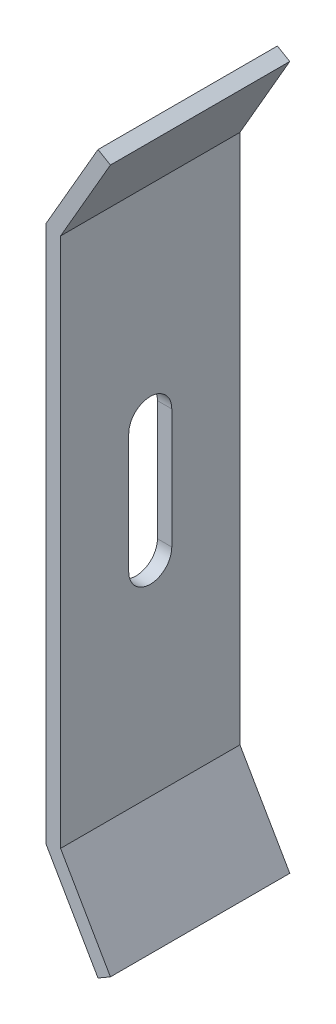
ISO-10303-21;
HEADER;
FILE_DESCRIPTION(('STEP AP214'),'2;1');
FILE_NAME('part.step','',(''),(''),'','','');
FILE_SCHEMA(('AUTOMOTIVE_DESIGN { 1 0 10303 214 1 1 1 1 }'));
ENDSEC;
DATA;
#1=APPLICATION_CONTEXT('core data for automotive mechanical design processes');
#2=APPLICATION_PROTOCOL_DEFINITION('international standard','automotive_design',2000,#1);
#3=PRODUCT_CONTEXT('',#1,'mechanical');
#4=PRODUCT('Part','Part','',(#3));
#5=PRODUCT_RELATED_PRODUCT_CATEGORY('part','',(#4));
#6=PRODUCT_DEFINITION_FORMATION('','',#4);
#7=PRODUCT_DEFINITION_CONTEXT('part definition',#1,'design');
#8=PRODUCT_DEFINITION('design','',#6,#7);
#9=PRODUCT_DEFINITION_SHAPE('','',#8);
#10=(LENGTH_UNIT() NAMED_UNIT(*) SI_UNIT(.MILLI.,.METRE.));
#11=(NAMED_UNIT(*) PLANE_ANGLE_UNIT() SI_UNIT($,.RADIAN.));
#12=(NAMED_UNIT(*) SI_UNIT($,.STERADIAN.) SOLID_ANGLE_UNIT());
#13=UNCERTAINTY_MEASURE_WITH_UNIT(LENGTH_MEASURE(1.E-05),#10,'distance_accuracy_value','');
#14=(GEOMETRIC_REPRESENTATION_CONTEXT(3) GLOBAL_UNCERTAINTY_ASSIGNED_CONTEXT((#13)) GLOBAL_UNIT_ASSIGNED_CONTEXT((#10,
#11,#12)) REPRESENTATION_CONTEXT('',''));
#15=CARTESIAN_POINT('',(0.,0.,0.));
#16=DIRECTION('',(0.,0.,1.));
#17=DIRECTION('',(1.,0.,0.));
#18=AXIS2_PLACEMENT_3D('',#15,#16,#17);
#19=CARTESIAN_POINT('',(1.31982271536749,27.813,19.05));
#20=DIRECTION('',(-0.866025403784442,0.499999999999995,0.));
#21=DIRECTION('',(-0.499999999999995,-0.866025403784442,0.));
#22=AXIS2_PLACEMENT_3D('',#19,#20,#21);
#23=PLANE('',#22);
#24=DIRECTION('',(0.499999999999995,0.866025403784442,0.));
#25=VECTOR('',#24,1.);
#26=CARTESIAN_POINT('',(1.31982271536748,27.813,0.));
#27=LINE('',#26,#25);
#28=CARTESIAN_POINT('',(1.524,28.1666454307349,0.));
#29=VERTEX_POINT('',#28);
#30=CARTESIAN_POINT('',(6.8190840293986,37.3380000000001,0.));
#31=VERTEX_POINT('',#30);
#32=EDGE_CURVE('E153',#29,#31,#27,.T.);
#33=ORIENTED_EDGE('',*,*,#32,.T.);
#34=DIRECTION('',(0.,0.,-1.));
#35=VECTOR('',#34,1.);
#36=CARTESIAN_POINT('',(6.8190840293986,37.3380000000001,19.05));
#37=LINE('',#36,#35);
#38=CARTESIAN_POINT('',(6.8190840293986,37.3380000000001,19.05));
#39=VERTEX_POINT('',#38);
#40=EDGE_CURVE('E11',#39,#31,#37,.T.);
#41=ORIENTED_EDGE('',*,*,#40,.F.);
#42=DIRECTION('',(0.499999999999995,0.866025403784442,0.));
#43=VECTOR('',#42,1.);
#44=CARTESIAN_POINT('',(1.31982271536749,27.813,19.05));
#45=LINE('',#44,#43);
#46=CARTESIAN_POINT('',(1.524,28.1666454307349,19.05));
#47=VERTEX_POINT('',#46);
#48=EDGE_CURVE('E177',#47,#39,#45,.T.);
#49=ORIENTED_EDGE('',*,*,#48,.F.);
#50=DIRECTION('',(0.,0.,-1.));
#51=VECTOR('',#50,1.);
#52=CARTESIAN_POINT('',(1.524,28.1666454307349,19.05));
#53=LINE('',#52,#51);
#54=EDGE_CURVE('E198',#47,#29,#53,.T.);
#55=ORIENTED_EDGE('',*,*,#54,.T.);
#56=EDGE_LOOP('',(#33,#41,#49,#55));
#57=FACE_BOUND('',#56,.T.);
#58=ADVANCED_FACE('F32',(#57),#23,.F.);
#59=CARTESIAN_POINT('',(5.49926131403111,38.1000000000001,19.05));
#60=DIRECTION('',(0.499999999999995,0.866025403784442,0.));
#61=DIRECTION('',(-0.866025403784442,0.499999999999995,0.));
#62=AXIS2_PLACEMENT_3D('',#59,#60,#61);
#63=PLANE('',#62);
#64=DIRECTION('',(0.866025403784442,-0.499999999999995,0.));
#65=VECTOR('',#64,1.);
#66=CARTESIAN_POINT('',(5.49926131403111,38.1000000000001,0.));
#67=LINE('',#66,#65);
#68=CARTESIAN_POINT('',(5.49926131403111,38.1000000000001,0.));
#69=VERTEX_POINT('',#68);
#70=EDGE_CURVE('E158',#69,#31,#67,.T.);
#71=ORIENTED_EDGE('',*,*,#70,.F.);
#72=DIRECTION('',(0.,0.,-1.));
#73=VECTOR('',#72,1.);
#74=CARTESIAN_POINT('',(5.49926131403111,38.1000000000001,19.05));
#75=LINE('',#74,#73);
#76=CARTESIAN_POINT('',(5.49926131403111,38.1000000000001,19.05));
#77=VERTEX_POINT('',#76);
#78=EDGE_CURVE('E39',#77,#69,#75,.T.);
#79=ORIENTED_EDGE('',*,*,#78,.F.);
#80=DIRECTION('',(0.866025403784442,-0.499999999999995,0.));
#81=VECTOR('',#80,1.);
#82=CARTESIAN_POINT('',(5.49926131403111,38.1000000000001,19.05));
#83=LINE('',#82,#81);
#84=EDGE_CURVE('E179',#77,#39,#83,.T.);
#85=ORIENTED_EDGE('',*,*,#84,.T.);
#86=ORIENTED_EDGE('',*,*,#40,.T.);
#87=EDGE_LOOP('',(#71,#79,#85,#86));
#88=FACE_BOUND('',#87,.T.);
#89=ADVANCED_FACE('F218',(#88),#63,.T.);
#90=CARTESIAN_POINT('',(0.,28.5749999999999,19.05));
#91=DIRECTION('',(-0.866025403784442,0.499999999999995,0.));
#92=DIRECTION('',(-0.499999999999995,-0.866025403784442,0.));
#93=AXIS2_PLACEMENT_3D('',#90,#91,#92);
#94=PLANE('',#93);
#95=DIRECTION('',(0.499999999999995,0.866025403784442,0.));
#96=VECTOR('',#95,1.);
#97=CARTESIAN_POINT('',(0.,28.575,0.));
#98=LINE('',#97,#96);
#99=CARTESIAN_POINT('',(0.,28.575,0.));
#100=VERTEX_POINT('',#99);
#101=EDGE_CURVE('E161',#100,#69,#98,.T.);
#102=ORIENTED_EDGE('',*,*,#101,.F.);
#103=DIRECTION('',(0.,0.,-1.));
#104=VECTOR('',#103,1.);
#105=CARTESIAN_POINT('',(0.,28.5749999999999,19.05));
#106=LINE('',#105,#104);
#107=CARTESIAN_POINT('',(0.,28.5749999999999,19.05));
#108=VERTEX_POINT('',#107);
#109=EDGE_CURVE('E210',#108,#100,#106,.T.);
#110=ORIENTED_EDGE('',*,*,#109,.F.);
#111=DIRECTION('',(0.499999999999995,0.866025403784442,0.));
#112=VECTOR('',#111,1.);
#113=CARTESIAN_POINT('',(0.,28.5749999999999,19.05));
#114=LINE('',#113,#112);
#115=EDGE_CURVE('E182',#108,#77,#114,.T.);
#116=ORIENTED_EDGE('',*,*,#115,.T.);
#117=ORIENTED_EDGE('',*,*,#78,.T.);
#118=EDGE_LOOP('',(#102,#110,#116,#117));
#119=FACE_BOUND('',#118,.T.);
#120=ADVANCED_FACE('F214',(#119),#94,.T.);
#121=CARTESIAN_POINT('',(0.,28.5749999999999,19.05));
#122=DIRECTION('',(-1.,0.,0.));
#123=DIRECTION('',(0.,0.,1.));
#124=AXIS2_PLACEMENT_3D('',#121,#122,#123);
#125=PLANE('',#124);
#126=CARTESIAN_POINT('',(0.,6.35,9.52500000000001));
#127=DIRECTION('',(1.,0.,0.));
#128=DIRECTION('',(0.,0.,1.));
#129=AXIS2_PLACEMENT_3D('',#126,#127,#128);
#130=CIRCLE('',#129,2.286);
#131=CARTESIAN_POINT('',(0.,6.34999999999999,7.239));
#132=VERTEX_POINT('',#131);
#133=CARTESIAN_POINT('',(0.,6.34999999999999,11.811));
#134=VERTEX_POINT('',#133);
#135=EDGE_CURVE('E139',#132,#134,#130,.T.);
#136=ORIENTED_EDGE('',*,*,#135,.T.);
#137=DIRECTION('',(0.,-1.,0.));
#138=VECTOR('',#137,1.);
#139=CARTESIAN_POINT('',(0.,6.34999999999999,11.811));
#140=LINE('',#139,#138);
#141=CARTESIAN_POINT('',(0.,-6.35,11.811));
#142=VERTEX_POINT('',#141);
#143=EDGE_CURVE('E145',#134,#142,#140,.T.);
#144=ORIENTED_EDGE('',*,*,#143,.T.);
#145=CARTESIAN_POINT('',(0.,-6.35000000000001,9.52500000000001));
#146=DIRECTION('',(1.,0.,0.));
#147=DIRECTION('',(0.,0.,-1.));
#148=AXIS2_PLACEMENT_3D('',#145,#146,#147);
#149=CIRCLE('',#148,2.286);
#150=CARTESIAN_POINT('',(0.,-6.35,7.239));
#151=VERTEX_POINT('',#150);
#152=EDGE_CURVE('E46',#142,#151,#149,.T.);
#153=ORIENTED_EDGE('',*,*,#152,.T.);
#154=DIRECTION('',(0.,1.,0.));
#155=VECTOR('',#154,1.);
#156=CARTESIAN_POINT('',(0.,6.34999999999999,7.239));
#157=LINE('',#156,#155);
#158=EDGE_CURVE('E148',#151,#132,#157,.T.);
#159=ORIENTED_EDGE('',*,*,#158,.T.);
#160=EDGE_LOOP('',(#136,#144,#153,#159));
#161=FACE_BOUND('',#160,.T.);
#162=DIRECTION('',(0.,1.,0.));
#163=VECTOR('',#162,1.);
#164=CARTESIAN_POINT('',(0.,28.575,0.));
#165=LINE('',#164,#163);
#166=CARTESIAN_POINT('',(0.,-28.575,0.));
#167=VERTEX_POINT('',#166);
#168=EDGE_CURVE('E164',#167,#100,#165,.T.);
#169=ORIENTED_EDGE('',*,*,#168,.F.);
#170=DIRECTION('',(0.,0.,-1.));
#171=VECTOR('',#170,1.);
#172=CARTESIAN_POINT('',(0.,-28.575,19.05));
#173=LINE('',#172,#171);
#174=CARTESIAN_POINT('',(0.,-28.575,19.05));
#175=VERTEX_POINT('',#174);
#176=EDGE_CURVE('E208',#175,#167,#173,.T.);
#177=ORIENTED_EDGE('',*,*,#176,.F.);
#178=DIRECTION('',(0.,1.,0.));
#179=VECTOR('',#178,1.);
#180=CARTESIAN_POINT('',(0.,28.5749999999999,19.05));
#181=LINE('',#180,#179);
#182=EDGE_CURVE('E185',#175,#108,#181,.T.);
#183=ORIENTED_EDGE('',*,*,#182,.T.);
#184=ORIENTED_EDGE('',*,*,#109,.T.);
#185=EDGE_LOOP('',(#169,#177,#183,#184));
#186=FACE_BOUND('',#185,.T.);
#187=ADVANCED_FACE('F226',(#161,#186),#125,.T.);
#188=CARTESIAN_POINT('',(0.,-28.575,19.05));
#189=DIRECTION('',(-0.866025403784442,-0.499999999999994,0.));
#190=DIRECTION('',(0.499999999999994,-0.866025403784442,0.));
#191=AXIS2_PLACEMENT_3D('',#188,#189,#190);
#192=PLANE('',#191);
#193=DIRECTION('',(-0.499999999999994,0.866025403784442,0.));
#194=VECTOR('',#193,1.);
#195=CARTESIAN_POINT('',(0.,-28.575,0.));
#196=LINE('',#195,#194);
#197=CARTESIAN_POINT('',(5.49926131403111,-38.1,0.));
#198=VERTEX_POINT('',#197);
#199=EDGE_CURVE('E167',#198,#167,#196,.T.);
#200=ORIENTED_EDGE('',*,*,#199,.F.);
#201=DIRECTION('',(0.,0.,-1.));
#202=VECTOR('',#201,1.);
#203=CARTESIAN_POINT('',(5.49926131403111,-38.1,19.05));
#204=LINE('',#203,#202);
#205=CARTESIAN_POINT('',(5.49926131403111,-38.1,19.05));
#206=VERTEX_POINT('',#205);
#207=EDGE_CURVE('E206',#206,#198,#204,.T.);
#208=ORIENTED_EDGE('',*,*,#207,.F.);
#209=DIRECTION('',(-0.499999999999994,0.866025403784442,0.));
#210=VECTOR('',#209,1.);
#211=CARTESIAN_POINT('',(0.,-28.575,19.05));
#212=LINE('',#211,#210);
#213=EDGE_CURVE('E188',#206,#175,#212,.T.);
#214=ORIENTED_EDGE('',*,*,#213,.T.);
#215=ORIENTED_EDGE('',*,*,#176,.T.);
#216=EDGE_LOOP('',(#200,#208,#214,#215));
#217=FACE_BOUND('',#216,.T.);
#218=ADVANCED_FACE('F246',(#217),#192,.T.);
#219=CARTESIAN_POINT('',(6.81908402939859,-37.338,19.05));
#220=DIRECTION('',(0.499999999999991,-0.866025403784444,0.));
#221=DIRECTION('',(0.866025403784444,0.499999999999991,0.));
#222=AXIS2_PLACEMENT_3D('',#219,#220,#221);
#223=PLANE('',#222);
#224=DIRECTION('',(-0.866025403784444,-0.499999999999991,0.));
#225=VECTOR('',#224,1.);
#226=CARTESIAN_POINT('',(6.81908402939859,-37.338,0.));
#227=LINE('',#226,#225);
#228=CARTESIAN_POINT('',(6.81908402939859,-37.338,0.));
#229=VERTEX_POINT('',#228);
#230=EDGE_CURVE('E170',#229,#198,#227,.T.);
#231=ORIENTED_EDGE('',*,*,#230,.F.);
#232=DIRECTION('',(0.,0.,-1.));
#233=VECTOR('',#232,1.);
#234=CARTESIAN_POINT('',(6.81908402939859,-37.338,19.05));
#235=LINE('',#234,#233);
#236=CARTESIAN_POINT('',(6.81908402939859,-37.338,19.05));
#237=VERTEX_POINT('',#236);
#238=EDGE_CURVE('E204',#237,#229,#235,.T.);
#239=ORIENTED_EDGE('',*,*,#238,.F.);
#240=DIRECTION('',(-0.866025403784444,-0.499999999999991,0.));
#241=VECTOR('',#240,1.);
#242=CARTESIAN_POINT('',(6.81908402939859,-37.338,19.05));
#243=LINE('',#242,#241);
#244=EDGE_CURVE('E191',#237,#206,#243,.T.);
#245=ORIENTED_EDGE('',*,*,#244,.T.);
#246=ORIENTED_EDGE('',*,*,#207,.T.);
#247=EDGE_LOOP('',(#231,#239,#245,#246));
#248=FACE_BOUND('',#247,.T.);
#249=ADVANCED_FACE('F244',(#248),#223,.T.);
#250=CARTESIAN_POINT('',(1.31982271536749,-27.813,19.05));
#251=DIRECTION('',(-0.866025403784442,-0.499999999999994,0.));
#252=DIRECTION('',(0.499999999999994,-0.866025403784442,0.));
#253=AXIS2_PLACEMENT_3D('',#250,#251,#252);
#254=PLANE('',#253);
#255=DIRECTION('',(-0.499999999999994,0.866025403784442,0.));
#256=VECTOR('',#255,1.);
#257=CARTESIAN_POINT('',(1.3198227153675,-27.813,0.));
#258=LINE('',#257,#256);
#259=CARTESIAN_POINT('',(1.524,-28.1666454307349,0.));
#260=VERTEX_POINT('',#259);
#261=EDGE_CURVE('E173',#229,#260,#258,.T.);
#262=ORIENTED_EDGE('',*,*,#261,.T.);
#263=DIRECTION('',(0.,0.,-1.));
#264=VECTOR('',#263,1.);
#265=CARTESIAN_POINT('',(1.524,-28.166645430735,19.05));
#266=LINE('',#265,#264);
#267=CARTESIAN_POINT('',(1.524,-28.166645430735,19.05));
#268=VERTEX_POINT('',#267);
#269=EDGE_CURVE('E201',#268,#260,#266,.T.);
#270=ORIENTED_EDGE('',*,*,#269,.F.);
#271=DIRECTION('',(-0.499999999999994,0.866025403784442,0.));
#272=VECTOR('',#271,1.);
#273=CARTESIAN_POINT('',(1.31982271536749,-27.813,19.05));
#274=LINE('',#273,#272);
#275=EDGE_CURVE('E194',#237,#268,#274,.T.);
#276=ORIENTED_EDGE('',*,*,#275,.F.);
#277=ORIENTED_EDGE('',*,*,#238,.T.);
#278=EDGE_LOOP('',(#262,#270,#276,#277));
#279=FACE_BOUND('',#278,.T.);
#280=ADVANCED_FACE('F241',(#279),#254,.F.);
#281=CARTESIAN_POINT('',(1.524,28.5749999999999,19.05));
#282=DIRECTION('',(-1.,0.,0.));
#283=DIRECTION('',(0.,0.,1.));
#284=AXIS2_PLACEMENT_3D('',#281,#282,#283);
#285=PLANE('',#284);
#286=DIRECTION('',(0.,-1.,0.));
#287=VECTOR('',#286,1.);
#288=CARTESIAN_POINT('',(1.524,6.35000000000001,11.811));
#289=LINE('',#288,#287);
#290=CARTESIAN_POINT('',(1.524,6.35000000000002,11.811));
#291=VERTEX_POINT('',#290);
#292=CARTESIAN_POINT('',(1.524,-6.35,11.811));
#293=VERTEX_POINT('',#292);
#294=EDGE_CURVE('E130',#291,#293,#289,.T.);
#295=ORIENTED_EDGE('',*,*,#294,.F.);
#296=CARTESIAN_POINT('',(1.524,6.35000000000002,9.52500000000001));
#297=DIRECTION('',(1.,0.,0.));
#298=DIRECTION('',(0.,0.,1.));
#299=AXIS2_PLACEMENT_3D('',#296,#297,#298);
#300=CIRCLE('',#299,2.286);
#301=CARTESIAN_POINT('',(1.524,6.35,7.239));
#302=VERTEX_POINT('',#301);
#303=EDGE_CURVE('E54',#302,#291,#300,.T.);
#304=ORIENTED_EDGE('',*,*,#303,.F.);
#305=DIRECTION('',(0.,1.,0.));
#306=VECTOR('',#305,1.);
#307=CARTESIAN_POINT('',(1.524,6.35,7.239));
#308=LINE('',#307,#306);
#309=CARTESIAN_POINT('',(1.52399999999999,-6.35,7.239));
#310=VERTEX_POINT('',#309);
#311=EDGE_CURVE('E137',#310,#302,#308,.T.);
#312=ORIENTED_EDGE('',*,*,#311,.F.);
#313=CARTESIAN_POINT('',(1.524,-6.35000000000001,9.52500000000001));
#314=DIRECTION('',(1.,0.,0.));
#315=DIRECTION('',(0.,0.,-1.));
#316=AXIS2_PLACEMENT_3D('',#313,#314,#315);
#317=CIRCLE('',#316,2.286);
#318=EDGE_CURVE('E121',#293,#310,#317,.T.);
#319=ORIENTED_EDGE('',*,*,#318,.F.);
#320=EDGE_LOOP('',(#295,#304,#312,#319));
#321=FACE_BOUND('',#320,.T.);
#322=DIRECTION('',(0.,1.,0.));
#323=VECTOR('',#322,1.);
#324=CARTESIAN_POINT('',(1.52400000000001,28.575,0.));
#325=LINE('',#324,#323);
#326=EDGE_CURVE('E175',#260,#29,#325,.T.);
#327=ORIENTED_EDGE('',*,*,#326,.T.);
#328=ORIENTED_EDGE('',*,*,#54,.F.);
#329=DIRECTION('',(0.,1.,0.));
#330=VECTOR('',#329,1.);
#331=CARTESIAN_POINT('',(1.524,28.5749999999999,19.05));
#332=LINE('',#331,#330);
#333=EDGE_CURVE('E196',#268,#47,#332,.T.);
#334=ORIENTED_EDGE('',*,*,#333,.F.);
#335=ORIENTED_EDGE('',*,*,#269,.T.);
#336=EDGE_LOOP('',(#327,#328,#334,#335));
#337=FACE_BOUND('',#336,.T.);
#338=ADVANCED_FACE('F134',(#321,#337),#285,.F.);
#339=CARTESIAN_POINT('',(6.8190840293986,37.3380000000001,19.05));
#340=DIRECTION('',(0.,0.,-1.));
#341=DIRECTION('',(-1.,0.,0.));
#342=AXIS2_PLACEMENT_3D('',#339,#340,#341);
#343=PLANE('',#342);
#344=ORIENTED_EDGE('',*,*,#48,.T.);
#345=ORIENTED_EDGE('',*,*,#84,.F.);
#346=ORIENTED_EDGE('',*,*,#115,.F.);
#347=ORIENTED_EDGE('',*,*,#182,.F.);
#348=ORIENTED_EDGE('',*,*,#213,.F.);
#349=ORIENTED_EDGE('',*,*,#244,.F.);
#350=ORIENTED_EDGE('',*,*,#275,.T.);
#351=ORIENTED_EDGE('',*,*,#333,.T.);
#352=EDGE_LOOP('',(#344,#345,#346,#347,#348,#349,#350,#351));
#353=FACE_BOUND('',#352,.T.);
#354=ADVANCED_FACE('F229',(#353),#343,.F.);
#355=CARTESIAN_POINT('',(6.8190840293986,37.3380000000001,0.));
#356=DIRECTION('',(0.,0.,-1.));
#357=DIRECTION('',(-1.,0.,0.));
#358=AXIS2_PLACEMENT_3D('',#355,#356,#357);
#359=PLANE('',#358);
#360=ORIENTED_EDGE('',*,*,#32,.F.);
#361=ORIENTED_EDGE('',*,*,#326,.F.);
#362=ORIENTED_EDGE('',*,*,#261,.F.);
#363=ORIENTED_EDGE('',*,*,#230,.T.);
#364=ORIENTED_EDGE('',*,*,#199,.T.);
#365=ORIENTED_EDGE('',*,*,#168,.T.);
#366=ORIENTED_EDGE('',*,*,#101,.T.);
#367=ORIENTED_EDGE('',*,*,#70,.T.);
#368=EDGE_LOOP('',(#360,#361,#362,#363,#364,#365,#366,#367));
#369=FACE_BOUND('',#368,.T.);
#370=ADVANCED_FACE('F222',(#369),#359,.T.);
#371=CARTESIAN_POINT('',(0.,6.35,9.52500000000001));
#372=DIRECTION('',(1.,0.,0.));
#373=DIRECTION('',(0.,0.,-1.));
#374=AXIS2_PLACEMENT_3D('',#371,#372,#373);
#375=CYLINDRICAL_SURFACE('',#374,2.286);
#376=ORIENTED_EDGE('',*,*,#303,.T.);
#377=DIRECTION('',(1.,0.,0.));
#378=VECTOR('',#377,1.);
#379=CARTESIAN_POINT('',(0.,6.34999999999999,11.811));
#380=LINE('',#379,#378);
#381=EDGE_CURVE('E127',#134,#291,#380,.T.);
#382=ORIENTED_EDGE('',*,*,#381,.F.);
#383=ORIENTED_EDGE('',*,*,#135,.F.);
#384=DIRECTION('',(1.,0.,0.));
#385=VECTOR('',#384,1.);
#386=CARTESIAN_POINT('',(0.,6.34999999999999,7.239));
#387=LINE('',#386,#385);
#388=EDGE_CURVE('E151',#132,#302,#387,.T.);
#389=ORIENTED_EDGE('',*,*,#388,.T.);
#390=EDGE_LOOP('',(#376,#382,#383,#389));
#391=FACE_BOUND('',#390,.T.);
#392=ADVANCED_FACE('F314',(#391),#375,.F.);
#393=CARTESIAN_POINT('',(0.,6.34999999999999,7.239));
#394=DIRECTION('',(0.,0.,-1.));
#395=DIRECTION('',(-1.,0.,0.));
#396=AXIS2_PLACEMENT_3D('',#393,#394,#395);
#397=PLANE('',#396);
#398=ORIENTED_EDGE('',*,*,#311,.T.);
#399=ORIENTED_EDGE('',*,*,#388,.F.);
#400=ORIENTED_EDGE('',*,*,#158,.F.);
#401=DIRECTION('',(1.,0.,0.));
#402=VECTOR('',#401,1.);
#403=CARTESIAN_POINT('',(0.,-6.35,7.239));
#404=LINE('',#403,#402);
#405=EDGE_CURVE('E126',#151,#310,#404,.T.);
#406=ORIENTED_EDGE('',*,*,#405,.T.);
#407=EDGE_LOOP('',(#398,#399,#400,#406));
#408=FACE_BOUND('',#407,.T.);
#409=ADVANCED_FACE('F323',(#408),#397,.F.);
#410=CARTESIAN_POINT('',(0.,-6.35000000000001,9.52500000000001));
#411=DIRECTION('',(1.,0.,0.));
#412=DIRECTION('',(0.,0.,-1.));
#413=AXIS2_PLACEMENT_3D('',#410,#411,#412);
#414=CYLINDRICAL_SURFACE('',#413,2.286);
#415=ORIENTED_EDGE('',*,*,#318,.T.);
#416=ORIENTED_EDGE('',*,*,#405,.F.);
#417=ORIENTED_EDGE('',*,*,#152,.F.);
#418=DIRECTION('',(1.,0.,0.));
#419=VECTOR('',#418,1.);
#420=CARTESIAN_POINT('',(0.,-6.35,11.811));
#421=LINE('',#420,#419);
#422=EDGE_CURVE('E117',#142,#293,#421,.T.);
#423=ORIENTED_EDGE('',*,*,#422,.T.);
#424=EDGE_LOOP('',(#415,#416,#417,#423));
#425=FACE_BOUND('',#424,.T.);
#426=ADVANCED_FACE('F119',(#425),#414,.F.);
#427=CARTESIAN_POINT('',(0.,6.34999999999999,11.811));
#428=DIRECTION('',(0.,0.,1.));
#429=DIRECTION('',(0.,-1.,0.));
#430=AXIS2_PLACEMENT_3D('',#427,#428,#429);
#431=PLANE('',#430);
#432=ORIENTED_EDGE('',*,*,#294,.T.);
#433=ORIENTED_EDGE('',*,*,#422,.F.);
#434=ORIENTED_EDGE('',*,*,#143,.F.);
#435=ORIENTED_EDGE('',*,*,#381,.T.);
#436=EDGE_LOOP('',(#432,#433,#434,#435));
#437=FACE_BOUND('',#436,.T.);
#438=ADVANCED_FACE('F131',(#437),#431,.F.);
#439=CLOSED_SHELL('',(#58,#89,#120,#187,#218,#249,#280,#338,#354,#370,#392,#409,#426,#438));
#440=MANIFOLD_SOLID_BREP('B2',#439);
#441=ADVANCED_BREP_SHAPE_REPRESENTATION('',(#18,#440),#14);
#442=SHAPE_DEFINITION_REPRESENTATION(#9,#441);
ENDSEC;
END-ISO-10303-21;
